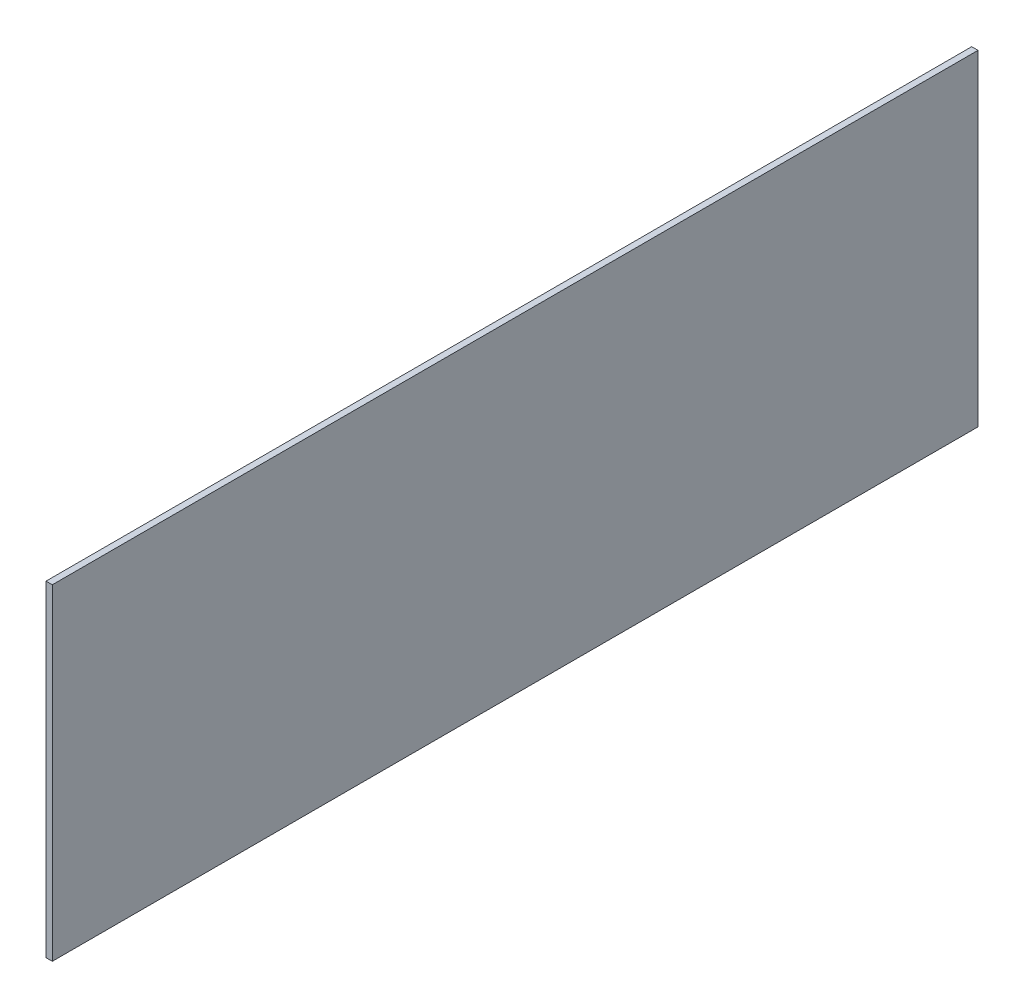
ISO-10303-21;
HEADER;
FILE_DESCRIPTION(('STEP AP214'),'2;1');
FILE_NAME('part.step','',(''),(''),'','','');
FILE_SCHEMA(('AUTOMOTIVE_DESIGN { 1 0 10303 214 1 1 1 1 }'));
ENDSEC;
DATA;
#1=APPLICATION_CONTEXT('core data for automotive mechanical design processes');
#2=APPLICATION_PROTOCOL_DEFINITION('international standard','automotive_design',2000,#1);
#3=PRODUCT_CONTEXT('',#1,'mechanical');
#4=PRODUCT('Part','Part','',(#3));
#5=PRODUCT_RELATED_PRODUCT_CATEGORY('part','',(#4));
#6=PRODUCT_DEFINITION_FORMATION('','',#4);
#7=PRODUCT_DEFINITION_CONTEXT('part definition',#1,'design');
#8=PRODUCT_DEFINITION('design','',#6,#7);
#9=PRODUCT_DEFINITION_SHAPE('','',#8);
#10=(LENGTH_UNIT() NAMED_UNIT(*) SI_UNIT(.MILLI.,.METRE.));
#11=(NAMED_UNIT(*) PLANE_ANGLE_UNIT() SI_UNIT($,.RADIAN.));
#12=(NAMED_UNIT(*) SI_UNIT($,.STERADIAN.) SOLID_ANGLE_UNIT());
#13=UNCERTAINTY_MEASURE_WITH_UNIT(LENGTH_MEASURE(1.E-05),#10,'distance_accuracy_value','');
#14=(GEOMETRIC_REPRESENTATION_CONTEXT(3) GLOBAL_UNCERTAINTY_ASSIGNED_CONTEXT((#13)) GLOBAL_UNIT_ASSIGNED_CONTEXT((#10,
#11,#12)) REPRESENTATION_CONTEXT('',''));
#15=CARTESIAN_POINT('',(0.,0.,0.));
#16=DIRECTION('',(0.,0.,1.));
#17=DIRECTION('',(1.,0.,0.));
#18=AXIS2_PLACEMENT_3D('',#15,#16,#17);
#19=CARTESIAN_POINT('',(3.,0.,0.));
#20=DIRECTION('',(0.,0.,-1.));
#21=DIRECTION('',(-1.,0.,0.));
#22=AXIS2_PLACEMENT_3D('',#19,#20,#21);
#23=PLANE('',#22);
#24=DIRECTION('',(0.,-1.,0.));
#25=VECTOR('',#24,1.);
#26=CARTESIAN_POINT('',(0.,0.,0.));
#27=LINE('',#26,#25);
#28=CARTESIAN_POINT('',(0.,155.,0.));
#29=VERTEX_POINT('',#28);
#30=CARTESIAN_POINT('',(0.,0.,0.));
#31=VERTEX_POINT('',#30);
#32=EDGE_CURVE('E113',#29,#31,#27,.T.);
#33=ORIENTED_EDGE('',*,*,#32,.T.);
#34=DIRECTION('',(-1.,0.,0.));
#35=VECTOR('',#34,1.);
#36=CARTESIAN_POINT('',(3.,0.,0.));
#37=LINE('',#36,#35);
#38=CARTESIAN_POINT('',(3.,0.,0.));
#39=VERTEX_POINT('',#38);
#40=EDGE_CURVE('E11',#39,#31,#37,.T.);
#41=ORIENTED_EDGE('',*,*,#40,.F.);
#42=DIRECTION('',(0.,-1.,0.));
#43=VECTOR('',#42,1.);
#44=CARTESIAN_POINT('',(3.,0.,0.));
#45=LINE('',#44,#43);
#46=CARTESIAN_POINT('',(3.,155.,0.));
#47=VERTEX_POINT('',#46);
#48=EDGE_CURVE('E97',#47,#39,#45,.T.);
#49=ORIENTED_EDGE('',*,*,#48,.F.);
#50=DIRECTION('',(-1.,0.,0.));
#51=VECTOR('',#50,1.);
#52=CARTESIAN_POINT('',(3.,155.,0.));
#53=LINE('',#52,#51);
#54=EDGE_CURVE('E109',#47,#29,#53,.T.);
#55=ORIENTED_EDGE('',*,*,#54,.T.);
#56=EDGE_LOOP('',(#33,#41,#49,#55));
#57=FACE_BOUND('',#56,.T.);
#58=ADVANCED_FACE('F45',(#57),#23,.F.);
#59=CARTESIAN_POINT('',(3.,0.,0.));
#60=DIRECTION('',(0.,1.,0.));
#61=DIRECTION('',(0.,0.,1.));
#62=AXIS2_PLACEMENT_3D('',#59,#60,#61);
#63=PLANE('',#62);
#64=DIRECTION('',(0.,0.,-1.));
#65=VECTOR('',#64,1.);
#66=CARTESIAN_POINT('',(0.,0.,0.));
#67=LINE('',#66,#65);
#68=CARTESIAN_POINT('',(0.,0.,-440.));
#69=VERTEX_POINT('',#68);
#70=EDGE_CURVE('E102',#31,#69,#67,.T.);
#71=ORIENTED_EDGE('',*,*,#70,.T.);
#72=DIRECTION('',(-1.,0.,0.));
#73=VECTOR('',#72,1.);
#74=CARTESIAN_POINT('',(3.,0.,-440.));
#75=LINE('',#74,#73);
#76=CARTESIAN_POINT('',(3.,0.,-440.));
#77=VERTEX_POINT('',#76);
#78=EDGE_CURVE('E54',#77,#69,#75,.T.);
#79=ORIENTED_EDGE('',*,*,#78,.F.);
#80=DIRECTION('',(0.,0.,-1.));
#81=VECTOR('',#80,1.);
#82=CARTESIAN_POINT('',(3.,0.,0.));
#83=LINE('',#82,#81);
#84=EDGE_CURVE('E92',#39,#77,#83,.T.);
#85=ORIENTED_EDGE('',*,*,#84,.F.);
#86=ORIENTED_EDGE('',*,*,#40,.T.);
#87=EDGE_LOOP('',(#71,#79,#85,#86));
#88=FACE_BOUND('',#87,.T.);
#89=ADVANCED_FACE('F101',(#88),#63,.F.);
#90=CARTESIAN_POINT('',(3.,0.,-440.));
#91=DIRECTION('',(0.,0.,1.));
#92=DIRECTION('',(1.,0.,0.));
#93=AXIS2_PLACEMENT_3D('',#90,#91,#92);
#94=PLANE('',#93);
#95=DIRECTION('',(0.,1.,0.));
#96=VECTOR('',#95,1.);
#97=CARTESIAN_POINT('',(0.,0.,-440.));
#98=LINE('',#97,#96);
#99=CARTESIAN_POINT('',(0.,155.,-440.));
#100=VERTEX_POINT('',#99);
#101=EDGE_CURVE('E79',#69,#100,#98,.T.);
#102=ORIENTED_EDGE('',*,*,#101,.T.);
#103=DIRECTION('',(-1.,0.,0.));
#104=VECTOR('',#103,1.);
#105=CARTESIAN_POINT('',(3.,155.,-440.));
#106=LINE('',#105,#104);
#107=CARTESIAN_POINT('',(3.,155.,-440.));
#108=VERTEX_POINT('',#107);
#109=EDGE_CURVE('E104',#108,#100,#106,.T.);
#110=ORIENTED_EDGE('',*,*,#109,.F.);
#111=DIRECTION('',(0.,1.,0.));
#112=VECTOR('',#111,1.);
#113=CARTESIAN_POINT('',(3.,0.,-440.));
#114=LINE('',#113,#112);
#115=EDGE_CURVE('E95',#77,#108,#114,.T.);
#116=ORIENTED_EDGE('',*,*,#115,.F.);
#117=ORIENTED_EDGE('',*,*,#78,.T.);
#118=EDGE_LOOP('',(#102,#110,#116,#117));
#119=FACE_BOUND('',#118,.T.);
#120=ADVANCED_FACE('F105',(#119),#94,.F.);
#121=CARTESIAN_POINT('',(3.,155.,0.));
#122=DIRECTION('',(0.,-1.,0.));
#123=DIRECTION('',(0.,0.,-1.));
#124=AXIS2_PLACEMENT_3D('',#121,#122,#123);
#125=PLANE('',#124);
#126=DIRECTION('',(0.,0.,1.));
#127=VECTOR('',#126,1.);
#128=CARTESIAN_POINT('',(0.,155.,0.));
#129=LINE('',#128,#127);
#130=EDGE_CURVE('E85',#100,#29,#129,.T.);
#131=ORIENTED_EDGE('',*,*,#130,.T.);
#132=ORIENTED_EDGE('',*,*,#54,.F.);
#133=DIRECTION('',(0.,0.,1.));
#134=VECTOR('',#133,1.);
#135=CARTESIAN_POINT('',(3.,155.,0.));
#136=LINE('',#135,#134);
#137=EDGE_CURVE('E62',#108,#47,#136,.T.);
#138=ORIENTED_EDGE('',*,*,#137,.F.);
#139=ORIENTED_EDGE('',*,*,#109,.T.);
#140=EDGE_LOOP('',(#131,#132,#138,#139));
#141=FACE_BOUND('',#140,.T.);
#142=ADVANCED_FACE('F126',(#141),#125,.F.);
#143=CARTESIAN_POINT('',(3.,0.,0.));
#144=DIRECTION('',(-1.,0.,0.));
#145=DIRECTION('',(0.,0.,1.));
#146=AXIS2_PLACEMENT_3D('',#143,#144,#145);
#147=PLANE('',#146);
#148=ORIENTED_EDGE('',*,*,#48,.T.);
#149=ORIENTED_EDGE('',*,*,#84,.T.);
#150=ORIENTED_EDGE('',*,*,#115,.T.);
#151=ORIENTED_EDGE('',*,*,#137,.T.);
#152=EDGE_LOOP('',(#148,#149,#150,#151));
#153=FACE_BOUND('',#152,.T.);
#154=ADVANCED_FACE('F93',(#153),#147,.F.);
#155=CARTESIAN_POINT('',(0.,0.,0.));
#156=DIRECTION('',(-1.,0.,0.));
#157=DIRECTION('',(0.,0.,1.));
#158=AXIS2_PLACEMENT_3D('',#155,#156,#157);
#159=PLANE('',#158);
#160=ORIENTED_EDGE('',*,*,#32,.F.);
#161=ORIENTED_EDGE('',*,*,#130,.F.);
#162=ORIENTED_EDGE('',*,*,#101,.F.);
#163=ORIENTED_EDGE('',*,*,#70,.F.);
#164=EDGE_LOOP('',(#160,#161,#162,#163));
#165=FACE_BOUND('',#164,.T.);
#166=ADVANCED_FACE('F129',(#165),#159,.T.);
#167=CLOSED_SHELL('',(#58,#89,#120,#142,#154,#166));
#168=MANIFOLD_SOLID_BREP('B2',#167);
#169=ADVANCED_BREP_SHAPE_REPRESENTATION('',(#18,#168),#14);
#170=SHAPE_DEFINITION_REPRESENTATION(#9,#169);
ENDSEC;
END-ISO-10303-21;
